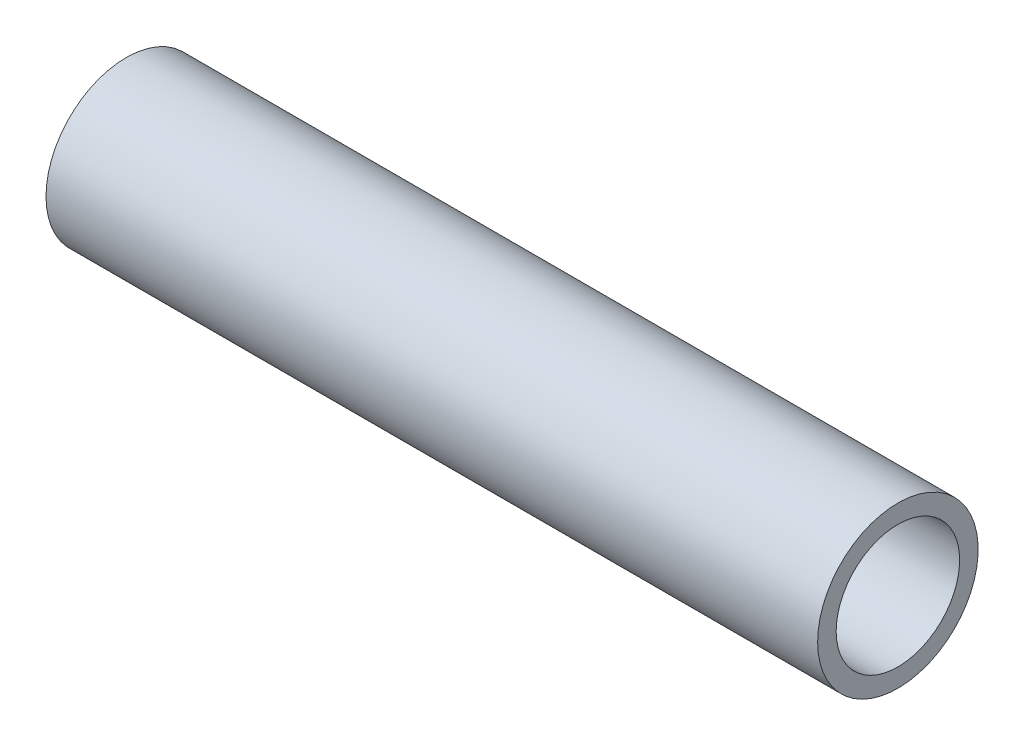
ISO-10303-21;
HEADER;
FILE_DESCRIPTION(('STEP AP214'),'2;1');
FILE_NAME('part.step','',(''),(''),'','','');
FILE_SCHEMA(('AUTOMOTIVE_DESIGN { 1 0 10303 214 1 1 1 1 }'));
ENDSEC;
DATA;
#1=APPLICATION_CONTEXT('core data for automotive mechanical design processes');
#2=APPLICATION_PROTOCOL_DEFINITION('international standard','automotive_design',2000,#1);
#3=PRODUCT_CONTEXT('',#1,'mechanical');
#4=PRODUCT('Part','Part','',(#3));
#5=PRODUCT_RELATED_PRODUCT_CATEGORY('part','',(#4));
#6=PRODUCT_DEFINITION_FORMATION('','',#4);
#7=PRODUCT_DEFINITION_CONTEXT('part definition',#1,'design');
#8=PRODUCT_DEFINITION('design','',#6,#7);
#9=PRODUCT_DEFINITION_SHAPE('','',#8);
#10=(LENGTH_UNIT() NAMED_UNIT(*) SI_UNIT(.MILLI.,.METRE.));
#11=(NAMED_UNIT(*) PLANE_ANGLE_UNIT() SI_UNIT($,.RADIAN.));
#12=(NAMED_UNIT(*) SI_UNIT($,.STERADIAN.) SOLID_ANGLE_UNIT());
#13=UNCERTAINTY_MEASURE_WITH_UNIT(LENGTH_MEASURE(1.E-05),#10,'distance_accuracy_value','');
#14=(GEOMETRIC_REPRESENTATION_CONTEXT(3) GLOBAL_UNCERTAINTY_ASSIGNED_CONTEXT((#13)) GLOBAL_UNIT_ASSIGNED_CONTEXT((#10,
#11,#12)) REPRESENTATION_CONTEXT('',''));
#15=CARTESIAN_POINT('',(0.,0.,0.));
#16=DIRECTION('',(0.,0.,1.));
#17=DIRECTION('',(1.,0.,0.));
#18=AXIS2_PLACEMENT_3D('',#15,#16,#17);
#19=CARTESIAN_POINT('',(158.75,0.,0.));
#20=DIRECTION('',(-1.,0.,0.));
#21=DIRECTION('',(0.,0.,1.));
#22=AXIS2_PLACEMENT_3D('',#19,#20,#21);
#23=CYLINDRICAL_SURFACE('',#22,12.7);
#24=CARTESIAN_POINT('',(158.75,0.,0.));
#25=DIRECTION('',(1.,0.,0.));
#26=DIRECTION('',(0.,0.,-1.));
#27=AXIS2_PLACEMENT_3D('',#24,#25,#26);
#28=CIRCLE('',#27,12.7);
#29=CARTESIAN_POINT('',(158.75,0.,12.7));
#30=VERTEX_POINT('',#29);
#31=EDGE_CURVE('E50',#30,#30,#28,.T.);
#32=CARTESIAN_POINT('',(0.,0.,0.));
#33=DIRECTION('',(1.,0.,0.));
#34=DIRECTION('',(0.,0.,-1.));
#35=AXIS2_PLACEMENT_3D('',#32,#33,#34);
#36=CIRCLE('',#35,12.7);
#37=CARTESIAN_POINT('',(0.,0.,12.7));
#38=VERTEX_POINT('',#37);
#39=EDGE_CURVE('E56',#38,#38,#36,.T.);
#40=CARTESIAN_POINT('',(158.75,0.,12.7));
#41=CARTESIAN_POINT('',(157.096354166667,0.,12.7));
#42=CARTESIAN_POINT('',(155.442708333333,0.,12.7));
#43=CARTESIAN_POINT('',(152.135416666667,0.,12.7));
#44=CARTESIAN_POINT('',(150.481770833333,0.,12.7));
#45=CARTESIAN_POINT('',(147.174479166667,0.,12.7));
#46=CARTESIAN_POINT('',(145.520833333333,0.,12.7));
#47=CARTESIAN_POINT('',(142.213541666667,0.,12.7));
#48=CARTESIAN_POINT('',(140.559895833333,0.,12.7));
#49=CARTESIAN_POINT('',(137.252604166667,0.,12.7));
#50=CARTESIAN_POINT('',(135.598958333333,0.,12.7));
#51=CARTESIAN_POINT('',(132.291666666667,0.,12.7));
#52=CARTESIAN_POINT('',(130.638020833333,0.,12.7));
#53=CARTESIAN_POINT('',(127.330729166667,0.,12.7));
#54=CARTESIAN_POINT('',(125.677083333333,0.,12.7));
#55=CARTESIAN_POINT('',(122.369791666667,0.,12.7));
#56=CARTESIAN_POINT('',(120.716145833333,0.,12.7));
#57=CARTESIAN_POINT('',(117.408854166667,0.,12.7));
#58=CARTESIAN_POINT('',(115.755208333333,0.,12.7));
#59=CARTESIAN_POINT('',(112.447916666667,0.,12.7));
#60=CARTESIAN_POINT('',(110.794270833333,0.,12.7));
#61=CARTESIAN_POINT('',(107.486979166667,0.,12.7));
#62=CARTESIAN_POINT('',(105.833333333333,0.,12.7));
#63=CARTESIAN_POINT('',(102.526041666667,0.,12.7));
#64=CARTESIAN_POINT('',(100.872395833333,0.,12.7));
#65=CARTESIAN_POINT('',(97.5651041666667,0.,12.7));
#66=CARTESIAN_POINT('',(95.9114583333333,0.,12.7));
#67=CARTESIAN_POINT('',(92.6041666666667,0.,12.7));
#68=CARTESIAN_POINT('',(90.9505208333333,0.,12.7));
#69=CARTESIAN_POINT('',(87.6432291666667,0.,12.7));
#70=CARTESIAN_POINT('',(85.9895833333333,0.,12.7));
#71=CARTESIAN_POINT('',(82.6822916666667,0.,12.7));
#72=CARTESIAN_POINT('',(81.0286458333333,0.,12.7));
#73=CARTESIAN_POINT('',(77.7213541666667,0.,12.7));
#74=CARTESIAN_POINT('',(76.0677083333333,0.,12.7));
#75=CARTESIAN_POINT('',(72.7604166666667,0.,12.7));
#76=CARTESIAN_POINT('',(71.1067708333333,0.,12.7));
#77=CARTESIAN_POINT('',(67.7994791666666,0.,12.7));
#78=CARTESIAN_POINT('',(66.1458333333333,0.,12.7));
#79=CARTESIAN_POINT('',(62.8385416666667,0.,12.7));
#80=CARTESIAN_POINT('',(61.1848958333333,0.,12.7));
#81=CARTESIAN_POINT('',(57.8776041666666,0.,12.7));
#82=CARTESIAN_POINT('',(56.2239583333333,0.,12.7));
#83=CARTESIAN_POINT('',(52.9166666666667,0.,12.7));
#84=CARTESIAN_POINT('',(51.2630208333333,0.,12.7));
#85=CARTESIAN_POINT('',(47.9557291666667,0.,12.7));
#86=CARTESIAN_POINT('',(46.3020833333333,0.,12.7));
#87=CARTESIAN_POINT('',(42.9947916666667,0.,12.7));
#88=CARTESIAN_POINT('',(41.3411458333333,0.,12.7));
#89=CARTESIAN_POINT('',(38.0338541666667,0.,12.7));
#90=CARTESIAN_POINT('',(36.3802083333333,0.,12.7));
#91=CARTESIAN_POINT('',(33.0729166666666,0.,12.7));
#92=CARTESIAN_POINT('',(31.4192708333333,0.,12.7));
#93=CARTESIAN_POINT('',(28.1119791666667,0.,12.7));
#94=CARTESIAN_POINT('',(26.4583333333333,0.,12.7));
#95=CARTESIAN_POINT('',(23.1510416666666,0.,12.7));
#96=CARTESIAN_POINT('',(21.4973958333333,0.,12.7));
#97=CARTESIAN_POINT('',(18.1901041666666,0.,12.7));
#98=CARTESIAN_POINT('',(16.5364583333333,0.,12.7));
#99=CARTESIAN_POINT('',(13.2291666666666,0.,12.7));
#100=CARTESIAN_POINT('',(11.5755208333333,0.,12.7));
#101=CARTESIAN_POINT('',(8.26822916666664,0.,12.7));
#102=CARTESIAN_POINT('',(6.61458333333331,0.,12.7));
#103=CARTESIAN_POINT('',(3.30729166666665,0.,12.7));
#104=CARTESIAN_POINT('',(1.65364583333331,0.,12.7));
#105=CARTESIAN_POINT('',(0.,0.,12.7));
#106=B_SPLINE_CURVE_WITH_KNOTS('',3,(#40,#41,#42,#43,#44,#45,#46,#47,#48,#49,#50,#51,#52,#53,
#54,#55,#56,#57,#58,#59,#60,#61,#62,#63,#64,#65,#66,#67,#68,#69,#70,#71,#72,#73,#74,#75,#76,#77,
#78,#79,#80,#81,#82,#83,#84,#85,#86,#87,#88,#89,#90,#91,#92,#93,#94,#95,#96,#97,#98,#99,#100,
#101,#102,#103,#104,#105),.UNSPECIFIED.,.F.,.F.,(4,2,2,2,2,2,2,2,2,2,2,2,2,2,2,2,2,2,2,2,2,2,2,
2,2,2,2,2,2,2,2,2,4),(0.,4.96093749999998,9.921875,14.8828125,19.84375,24.8046875,29.765625,
34.7265625,39.6875,44.6484375,49.609375,54.5703125,59.53125,64.4921875,69.453125,74.4140625,
79.375,84.3359375,89.296875,94.2578125,99.21875,104.1796875,109.140625,114.1015625,119.0625,
124.0234375,128.984375,133.9453125,138.90625,143.8671875,148.828125,153.7890625,158.75),.UNSPECIFIED.);
#107=EDGE_CURVE('BSEAM43',#30,#38,#106,.T.);
#108=ORIENTED_EDGE('',*,*,#31,.T.);
#109=ORIENTED_EDGE('',*,*,#39,.F.);
#110=ORIENTED_EDGE('',*,*,#107,.T.);
#111=ORIENTED_EDGE('',*,*,#107,.F.);
#112=EDGE_LOOP('',(#108,#110,#109,#111));
#113=FACE_BOUND('',#112,.T.);
#114=ADVANCED_FACE('F43',(#113),#23,.F.);
#115=CARTESIAN_POINT('',(158.75,0.,0.));
#116=DIRECTION('',(-1.,0.,0.));
#117=DIRECTION('',(0.,0.,1.));
#118=AXIS2_PLACEMENT_3D('',#115,#116,#117);
#119=CYLINDRICAL_SURFACE('',#118,16.51);
#120=CARTESIAN_POINT('',(158.75,0.,0.));
#121=DIRECTION('',(1.,0.,0.));
#122=DIRECTION('',(0.,0.,-1.));
#123=AXIS2_PLACEMENT_3D('',#120,#121,#122);
#124=CIRCLE('',#123,16.51);
#125=CARTESIAN_POINT('',(158.75,0.,16.51));
#126=VERTEX_POINT('',#125);
#127=EDGE_CURVE('E10',#126,#126,#124,.T.);
#128=CARTESIAN_POINT('',(0.,0.,0.));
#129=DIRECTION('',(1.,0.,0.));
#130=DIRECTION('',(0.,0.,-1.));
#131=AXIS2_PLACEMENT_3D('',#128,#129,#130);
#132=CIRCLE('',#131,16.51);
#133=CARTESIAN_POINT('',(0.,0.,16.51));
#134=VERTEX_POINT('',#133);
#135=EDGE_CURVE('E46',#134,#134,#132,.T.);
#136=CARTESIAN_POINT('',(158.75,0.,16.51));
#137=CARTESIAN_POINT('',(157.096354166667,0.,16.51));
#138=CARTESIAN_POINT('',(155.442708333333,0.,16.51));
#139=CARTESIAN_POINT('',(152.135416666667,0.,16.51));
#140=CARTESIAN_POINT('',(150.481770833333,0.,16.51));
#141=CARTESIAN_POINT('',(147.174479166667,0.,16.51));
#142=CARTESIAN_POINT('',(145.520833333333,0.,16.51));
#143=CARTESIAN_POINT('',(142.213541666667,0.,16.51));
#144=CARTESIAN_POINT('',(140.559895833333,0.,16.51));
#145=CARTESIAN_POINT('',(137.252604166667,0.,16.51));
#146=CARTESIAN_POINT('',(135.598958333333,0.,16.51));
#147=CARTESIAN_POINT('',(132.291666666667,0.,16.51));
#148=CARTESIAN_POINT('',(130.638020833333,0.,16.51));
#149=CARTESIAN_POINT('',(127.330729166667,0.,16.51));
#150=CARTESIAN_POINT('',(125.677083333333,0.,16.51));
#151=CARTESIAN_POINT('',(122.369791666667,0.,16.51));
#152=CARTESIAN_POINT('',(120.716145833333,0.,16.51));
#153=CARTESIAN_POINT('',(117.408854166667,0.,16.51));
#154=CARTESIAN_POINT('',(115.755208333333,0.,16.51));
#155=CARTESIAN_POINT('',(112.447916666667,0.,16.51));
#156=CARTESIAN_POINT('',(110.794270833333,0.,16.51));
#157=CARTESIAN_POINT('',(107.486979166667,0.,16.51));
#158=CARTESIAN_POINT('',(105.833333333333,0.,16.51));
#159=CARTESIAN_POINT('',(102.526041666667,0.,16.51));
#160=CARTESIAN_POINT('',(100.872395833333,0.,16.51));
#161=CARTESIAN_POINT('',(97.5651041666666,0.,16.51));
#162=CARTESIAN_POINT('',(95.9114583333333,0.,16.51));
#163=CARTESIAN_POINT('',(92.6041666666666,0.,16.51));
#164=CARTESIAN_POINT('',(90.9505208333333,0.,16.51));
#165=CARTESIAN_POINT('',(87.6432291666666,0.,16.51));
#166=CARTESIAN_POINT('',(85.9895833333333,0.,16.51));
#167=CARTESIAN_POINT('',(82.6822916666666,0.,16.51));
#168=CARTESIAN_POINT('',(81.0286458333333,0.,16.51));
#169=CARTESIAN_POINT('',(77.7213541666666,0.,16.51));
#170=CARTESIAN_POINT('',(76.0677083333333,0.,16.51));
#171=CARTESIAN_POINT('',(72.7604166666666,0.,16.51));
#172=CARTESIAN_POINT('',(71.1067708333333,0.,16.51));
#173=CARTESIAN_POINT('',(67.7994791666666,0.,16.51));
#174=CARTESIAN_POINT('',(66.1458333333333,0.,16.51));
#175=CARTESIAN_POINT('',(62.8385416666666,0.,16.51));
#176=CARTESIAN_POINT('',(61.1848958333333,0.,16.51));
#177=CARTESIAN_POINT('',(57.8776041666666,0.,16.51));
#178=CARTESIAN_POINT('',(56.2239583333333,0.,16.51));
#179=CARTESIAN_POINT('',(52.9166666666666,0.,16.51));
#180=CARTESIAN_POINT('',(51.2630208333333,0.,16.51));
#181=CARTESIAN_POINT('',(47.9557291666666,0.,16.51));
#182=CARTESIAN_POINT('',(46.3020833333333,0.,16.51));
#183=CARTESIAN_POINT('',(42.9947916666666,0.,16.51));
#184=CARTESIAN_POINT('',(41.3411458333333,0.,16.51));
#185=CARTESIAN_POINT('',(38.0338541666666,0.,16.51));
#186=CARTESIAN_POINT('',(36.3802083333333,0.,16.51));
#187=CARTESIAN_POINT('',(33.0729166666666,0.,16.51));
#188=CARTESIAN_POINT('',(31.4192708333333,0.,16.51));
#189=CARTESIAN_POINT('',(28.1119791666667,0.,16.51));
#190=CARTESIAN_POINT('',(26.4583333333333,0.,16.51));
#191=CARTESIAN_POINT('',(23.1510416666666,0.,16.51));
#192=CARTESIAN_POINT('',(21.4973958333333,0.,16.51));
#193=CARTESIAN_POINT('',(18.1901041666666,0.,16.51));
#194=CARTESIAN_POINT('',(16.5364583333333,0.,16.51));
#195=CARTESIAN_POINT('',(13.2291666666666,0.,16.51));
#196=CARTESIAN_POINT('',(11.5755208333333,0.,16.51));
#197=CARTESIAN_POINT('',(8.26822916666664,0.,16.51));
#198=CARTESIAN_POINT('',(6.61458333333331,0.,16.51));
#199=CARTESIAN_POINT('',(3.30729166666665,0.,16.51));
#200=CARTESIAN_POINT('',(1.65364583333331,0.,16.51));
#201=CARTESIAN_POINT('',(0.,0.,16.51));
#202=B_SPLINE_CURVE_WITH_KNOTS('',3,(#136,#137,#138,#139,#140,#141,#142,#143,#144,#145,#146,
#147,#148,#149,#150,#151,#152,#153,#154,#155,#156,#157,#158,#159,#160,#161,#162,#163,#164,#165,
#166,#167,#168,#169,#170,#171,#172,#173,#174,#175,#176,#177,#178,#179,#180,#181,#182,#183,#184,
#185,#186,#187,#188,#189,#190,#191,#192,#193,#194,#195,#196,#197,#198,#199,#200,#201),
.UNSPECIFIED.,.F.,.F.,(4,2,2,2,2,2,2,2,2,2,2,2,2,2,2,2,2,2,2,2,2,2,2,2,2,2,2,2,2,2,2,2,4),(0.,
4.96093750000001,9.92187500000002,14.8828125,19.84375,24.8046875,29.765625,34.7265625,39.6875,
44.6484375,49.609375,54.5703125,59.53125,64.4921875,69.453125,74.4140625,79.375,84.3359375,
89.296875,94.2578125,99.21875,104.1796875,109.140625,114.1015625,119.0625,124.0234375,
128.984375,133.9453125,138.90625,143.8671875,148.828125,153.7890625,158.75),.UNSPECIFIED.);
#203=EDGE_CURVE('BSEAM63',#126,#134,#202,.T.);
#204=ORIENTED_EDGE('',*,*,#127,.F.);
#205=ORIENTED_EDGE('',*,*,#135,.T.);
#206=ORIENTED_EDGE('',*,*,#203,.T.);
#207=ORIENTED_EDGE('',*,*,#203,.F.);
#208=EDGE_LOOP('',(#204,#206,#205,#207));
#209=FACE_BOUND('',#208,.T.);
#210=ADVANCED_FACE('F63',(#209),#119,.T.);
#211=CARTESIAN_POINT('',(158.75,0.,0.));
#212=DIRECTION('',(1.,0.,0.));
#213=DIRECTION('',(0.,0.,-1.));
#214=AXIS2_PLACEMENT_3D('',#211,#212,#213);
#215=PLANE('',#214);
#216=ORIENTED_EDGE('',*,*,#31,.F.);
#217=EDGE_LOOP('',(#216));
#218=FACE_BOUND('',#217,.T.);
#219=ORIENTED_EDGE('',*,*,#127,.T.);
#220=EDGE_LOOP('',(#219));
#221=FACE_BOUND('',#220,.T.);
#222=ADVANCED_FACE('F67',(#218,#221),#215,.T.);
#223=CARTESIAN_POINT('',(0.,0.,0.));
#224=DIRECTION('',(1.,0.,0.));
#225=DIRECTION('',(0.,0.,-1.));
#226=AXIS2_PLACEMENT_3D('',#223,#224,#225);
#227=PLANE('',#226);
#228=ORIENTED_EDGE('',*,*,#39,.T.);
#229=EDGE_LOOP('',(#228));
#230=FACE_BOUND('',#229,.T.);
#231=ORIENTED_EDGE('',*,*,#135,.F.);
#232=EDGE_LOOP('',(#231));
#233=FACE_BOUND('',#232,.T.);
#234=ADVANCED_FACE('F65',(#230,#233),#227,.F.);
#235=CLOSED_SHELL('',(#114,#210,#222,#234));
#236=MANIFOLD_SOLID_BREP('B2',#235);
#237=ADVANCED_BREP_SHAPE_REPRESENTATION('',(#18,#236),#14);
#238=SHAPE_DEFINITION_REPRESENTATION(#9,#237);
ENDSEC;
END-ISO-10303-21;
